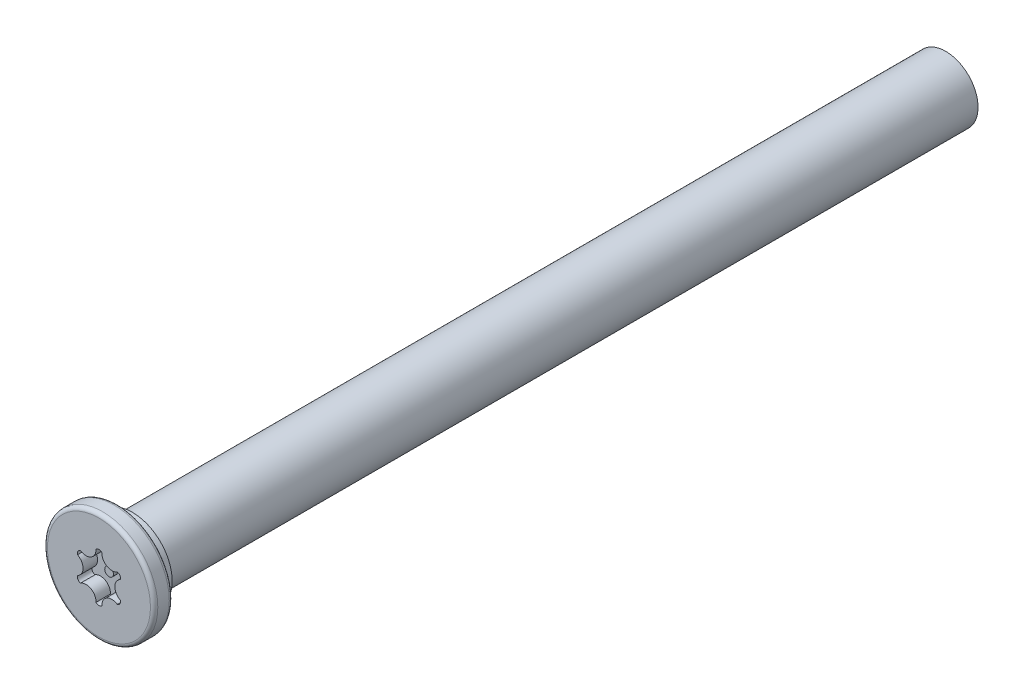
ISO-10303-21;
HEADER;
FILE_DESCRIPTION(('STEP AP214'),'2;1');
FILE_NAME('part.step','',(''),(''),'','','');
FILE_SCHEMA(('AUTOMOTIVE_DESIGN { 1 0 10303 214 1 1 1 1 }'));
ENDSEC;
DATA;
#1=APPLICATION_CONTEXT('core data for automotive mechanical design processes');
#2=APPLICATION_PROTOCOL_DEFINITION('international standard','automotive_design',2000,#1);
#3=PRODUCT_CONTEXT('',#1,'mechanical');
#4=PRODUCT('Part','Part','',(#3));
#5=PRODUCT_RELATED_PRODUCT_CATEGORY('part','',(#4));
#6=PRODUCT_DEFINITION_FORMATION('','',#4);
#7=PRODUCT_DEFINITION_CONTEXT('part definition',#1,'design');
#8=PRODUCT_DEFINITION('design','',#6,#7);
#9=PRODUCT_DEFINITION_SHAPE('','',#8);
#10=(LENGTH_UNIT() NAMED_UNIT(*) SI_UNIT(.MILLI.,.METRE.));
#11=(NAMED_UNIT(*) PLANE_ANGLE_UNIT() SI_UNIT($,.RADIAN.));
#12=(NAMED_UNIT(*) SI_UNIT($,.STERADIAN.) SOLID_ANGLE_UNIT());
#13=UNCERTAINTY_MEASURE_WITH_UNIT(LENGTH_MEASURE(1.E-05),#10,'distance_accuracy_value','');
#14=(GEOMETRIC_REPRESENTATION_CONTEXT(3) GLOBAL_UNCERTAINTY_ASSIGNED_CONTEXT((#13)) GLOBAL_UNIT_ASSIGNED_CONTEXT((#10,
#11,#12)) REPRESENTATION_CONTEXT('',''));
#15=CARTESIAN_POINT('',(0.,0.,0.));
#16=DIRECTION('',(0.,0.,1.));
#17=DIRECTION('',(1.,0.,0.));
#18=AXIS2_PLACEMENT_3D('',#15,#16,#17);
#19=CARTESIAN_POINT('',(0.,0.,0.));
#20=DIRECTION('',(0.,0.,1.));
#21=DIRECTION('',(1.,0.,0.));
#22=AXIS2_PLACEMENT_3D('',#19,#20,#21);
#23=PLANE('',#22);
#24=CARTESIAN_POINT('',(0.,0.,0.));
#25=DIRECTION('',(0.,0.,1.));
#26=DIRECTION('',(1.,0.,0.));
#27=AXIS2_PLACEMENT_3D('',#24,#25,#26);
#28=CIRCLE('',#27,3.55599999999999);
#29=CARTESIAN_POINT('',(3.55599999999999,0.,0.));
#30=VERTEX_POINT('',#29);
#31=EDGE_CURVE('E54',#30,#30,#28,.T.);
#32=ORIENTED_EDGE('',*,*,#31,.T.);
#33=EDGE_LOOP('',(#32));
#34=FACE_BOUND('',#33,.T.);
#35=CARTESIAN_POINT('',(0.893828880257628,1.54815703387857,0.));
#36=DIRECTION('',(0.,0.,1.));
#37=DIRECTION('',(1.,0.,0.));
#38=AXIS2_PLACEMENT_3D('',#35,#36,#37);
#39=CIRCLE('',#38,0.69);
#40=CARTESIAN_POINT('',(0.205060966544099,1.58937306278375,0.));
#41=VERTEX_POINT('',#40);
#42=CARTESIAN_POINT('',(1.27390696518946,0.972274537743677,0.));
#43=VERTEX_POINT('',#42);
#44=EDGE_CURVE('E181',#41,#43,#39,.T.);
#45=ORIENTED_EDGE('',*,*,#44,.T.);
#46=CARTESIAN_POINT('',(1.19884944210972,0.692156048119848,0.));
#47=DIRECTION('',(0.,0.,1.));
#48=DIRECTION('',(1.,0.,0.));
#49=AXIS2_PLACEMENT_3D('',#46,#47,#48);
#50=CIRCLE('',#49,0.29);
#51=CARTESIAN_POINT('',(1.47896793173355,0.617098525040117,0.));
#52=VERTEX_POINT('',#51);
#53=EDGE_CURVE('E61',#43,#52,#50,.F.);
#54=ORIENTED_EDGE('',*,*,#53,.T.);
#55=CARTESIAN_POINT('',(1.78765776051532,0.,0.));
#56=DIRECTION('',(0.,0.,1.));
#57=DIRECTION('',(1.,0.,0.));
#58=AXIS2_PLACEMENT_3D('',#55,#56,#57);
#59=CIRCLE('',#58,0.69);
#60=CARTESIAN_POINT('',(1.47896793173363,-0.617098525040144,0.));
#61=VERTEX_POINT('',#60);
#62=EDGE_CURVE('E111',#52,#61,#59,.T.);
#63=ORIENTED_EDGE('',*,*,#62,.T.);
#64=CARTESIAN_POINT('',(1.1988494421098,-0.692156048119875,0.));
#65=DIRECTION('',(0.,0.,1.));
#66=DIRECTION('',(1.,0.,0.));
#67=AXIS2_PLACEMENT_3D('',#64,#65,#66);
#68=CIRCLE('',#67,0.29);
#69=CARTESIAN_POINT('',(1.27390696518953,-0.972274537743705,0.));
#70=VERTEX_POINT('',#69);
#71=EDGE_CURVE('E216',#61,#70,#68,.F.);
#72=ORIENTED_EDGE('',*,*,#71,.T.);
#73=CARTESIAN_POINT('',(0.893828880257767,-1.54815703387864,0.));
#74=DIRECTION('',(0.,0.,1.));
#75=DIRECTION('',(1.,0.,0.));
#76=AXIS2_PLACEMENT_3D('',#73,#74,#75);
#77=CIRCLE('',#76,0.69);
#78=CARTESIAN_POINT('',(0.205060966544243,-1.5893730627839,0.));
#79=VERTEX_POINT('',#78);
#80=EDGE_CURVE('E160',#70,#79,#77,.T.);
#81=ORIENTED_EDGE('',*,*,#80,.T.);
#82=CARTESIAN_POINT('',(1.43067375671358E-13,-1.3843120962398,0.));
#83=DIRECTION('',(0.,0.,1.));
#84=DIRECTION('',(1.,0.,0.));
#85=AXIS2_PLACEMENT_3D('',#82,#83,#84);
#86=CIRCLE('',#85,0.29);
#87=CARTESIAN_POINT('',(-0.205060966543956,-1.5893730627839,0.));
#88=VERTEX_POINT('',#87);
#89=EDGE_CURVE('E210',#79,#88,#86,.F.);
#90=ORIENTED_EDGE('',*,*,#89,.T.);
#91=CARTESIAN_POINT('',(-0.893828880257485,-1.54815703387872,0.));
#92=DIRECTION('',(0.,0.,1.));
#93=DIRECTION('',(1.,0.,0.));
#94=AXIS2_PLACEMENT_3D('',#91,#92,#93);
#95=CIRCLE('',#94,0.69);
#96=CARTESIAN_POINT('',(-1.27390696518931,-0.97227453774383,0.));
#97=VERTEX_POINT('',#96);
#98=EDGE_CURVE('E206',#88,#97,#95,.T.);
#99=ORIENTED_EDGE('',*,*,#98,.T.);
#100=CARTESIAN_POINT('',(-1.19884944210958,-0.69215604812,0.));
#101=DIRECTION('',(0.,0.,1.));
#102=DIRECTION('',(1.,0.,0.));
#103=AXIS2_PLACEMENT_3D('',#100,#101,#102);
#104=CIRCLE('',#103,0.29);
#105=CARTESIAN_POINT('',(-1.47896793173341,-0.617098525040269,0.));
#106=VERTEX_POINT('',#105);
#107=EDGE_CURVE('E202',#97,#106,#104,.F.);
#108=ORIENTED_EDGE('',*,*,#107,.T.);
#109=CARTESIAN_POINT('',(-1.78765776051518,-1.56674837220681E-13,0.));
#110=DIRECTION('',(0.,0.,1.));
#111=DIRECTION('',(1.,0.,0.));
#112=AXIS2_PLACEMENT_3D('',#109,#110,#111);
#113=CIRCLE('',#112,0.69);
#114=CARTESIAN_POINT('',(-1.47896793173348,0.617098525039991,0.));
#115=VERTEX_POINT('',#114);
#116=EDGE_CURVE('E198',#106,#115,#113,.T.);
#117=ORIENTED_EDGE('',*,*,#116,.T.);
#118=CARTESIAN_POINT('',(-1.19884944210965,0.692156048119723,0.));
#119=DIRECTION('',(0.,0.,1.));
#120=DIRECTION('',(1.,0.,0.));
#121=AXIS2_PLACEMENT_3D('',#118,#119,#120);
#122=CIRCLE('',#121,0.29);
#123=CARTESIAN_POINT('',(-1.27390696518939,0.972274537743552,0.));
#124=VERTEX_POINT('',#123);
#125=EDGE_CURVE('E194',#115,#124,#122,.F.);
#126=ORIENTED_EDGE('',*,*,#125,.T.);
#127=CARTESIAN_POINT('',(-0.893828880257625,1.54815703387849,0.));
#128=DIRECTION('',(0.,0.,1.));
#129=DIRECTION('',(1.,0.,0.));
#130=AXIS2_PLACEMENT_3D('',#127,#128,#129);
#131=CIRCLE('',#130,0.690000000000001);
#132=CARTESIAN_POINT('',(-0.205060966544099,1.58937306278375,0.));
#133=VERTEX_POINT('',#132);
#134=EDGE_CURVE('E190',#124,#133,#131,.T.);
#135=ORIENTED_EDGE('',*,*,#134,.T.);
#136=CARTESIAN_POINT('',(0.,1.38431209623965,0.));
#137=DIRECTION('',(0.,0.,1.));
#138=DIRECTION('',(1.,0.,0.));
#139=AXIS2_PLACEMENT_3D('',#136,#137,#138);
#140=CIRCLE('',#139,0.29);
#141=EDGE_CURVE('E186',#133,#41,#140,.F.);
#142=ORIENTED_EDGE('',*,*,#141,.T.);
#143=EDGE_LOOP('',(#45,#54,#63,#72,#81,#90,#99,#108,#117,#126,#135,#142));
#144=FACE_BOUND('',#143,.T.);
#145=ADVANCED_FACE('F45',(#34,#144),#23,.T.);
#146=CARTESIAN_POINT('',(0.,0.,-1.3));
#147=DIRECTION('',(0.,0.,1.));
#148=DIRECTION('',(1.,0.,0.));
#149=AXIS2_PLACEMENT_3D('',#146,#147,#148);
#150=PLANE('',#149);
#151=CARTESIAN_POINT('',(0.,0.,-1.3));
#152=DIRECTION('',(0.,0.,1.));
#153=DIRECTION('',(1.,0.,0.));
#154=AXIS2_PLACEMENT_3D('',#151,#152,#153);
#155=CIRCLE('',#154,2.738000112);
#156=CARTESIAN_POINT('',(2.738000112,0.,-1.3));
#157=VERTEX_POINT('',#156);
#158=EDGE_CURVE('E11',#157,#157,#155,.F.);
#159=ORIENTED_EDGE('',*,*,#158,.F.);
#160=EDGE_LOOP('',(#159));
#161=FACE_BOUND('',#160,.T.);
#162=CARTESIAN_POINT('',(0.,0.,-1.3));
#163=DIRECTION('',(0.,0.,1.));
#164=DIRECTION('',(1.,0.,0.));
#165=AXIS2_PLACEMENT_3D('',#162,#163,#164);
#166=CIRCLE('',#165,3.55599999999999);
#167=CARTESIAN_POINT('',(3.55599999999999,0.,-1.3));
#168=VERTEX_POINT('',#167);
#169=EDGE_CURVE('E260',#168,#168,#166,.F.);
#170=ORIENTED_EDGE('',*,*,#169,.T.);
#171=EDGE_LOOP('',(#170));
#172=FACE_BOUND('',#171,.T.);
#173=ADVANCED_FACE('F283',(#161,#172),#150,.F.);
#174=CARTESIAN_POINT('',(0.,0.,-1.3));
#175=DIRECTION('',(0.,0.,1.));
#176=DIRECTION('',(1.,0.,0.));
#177=AXIS2_PLACEMENT_3D('',#174,#175,#176);
#178=CYLINDRICAL_SURFACE('',#177,3.80999999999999);
#179=CARTESIAN_POINT('',(0.,0.,-1.046));
#180=DIRECTION('',(0.,0.,1.));
#181=DIRECTION('',(1.,0.,0.));
#182=AXIS2_PLACEMENT_3D('',#179,#180,#181);
#183=CIRCLE('',#182,3.80999999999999);
#184=CARTESIAN_POINT('',(3.80999999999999,0.,-1.046));
#185=VERTEX_POINT('',#184);
#186=EDGE_CURVE('E256',#185,#185,#183,.T.);
#187=ORIENTED_EDGE('',*,*,#186,.T.);
#188=EDGE_LOOP('',(#187));
#189=FACE_BOUND('',#188,.T.);
#190=CARTESIAN_POINT('',(0.,0.,-0.254));
#191=DIRECTION('',(0.,0.,1.));
#192=DIRECTION('',(1.,0.,0.));
#193=AXIS2_PLACEMENT_3D('',#190,#191,#192);
#194=CIRCLE('',#193,3.80999999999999);
#195=CARTESIAN_POINT('',(3.80999999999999,0.,-0.254));
#196=VERTEX_POINT('',#195);
#197=EDGE_CURVE('E225',#196,#196,#194,.F.);
#198=ORIENTED_EDGE('',*,*,#197,.T.);
#199=EDGE_LOOP('',(#198));
#200=FACE_BOUND('',#199,.T.);
#201=ADVANCED_FACE('F289',(#189,#200),#178,.T.);
#202=CARTESIAN_POINT('',(1.19884944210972,0.692156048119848,-1.));
#203=DIRECTION('',(0.,0.,1.));
#204=DIRECTION('',(1.,0.,0.));
#205=AXIS2_PLACEMENT_3D('',#202,#203,#204);
#206=CYLINDRICAL_SURFACE('',#205,0.29);
#207=ORIENTED_EDGE('',*,*,#53,.F.);
#208=DIRECTION('',(0.,0.,1.));
#209=VECTOR('',#208,1.);
#210=CARTESIAN_POINT('',(1.27390696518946,0.972274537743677,-1.));
#211=LINE('',#210,#209);
#212=CARTESIAN_POINT('',(1.27390696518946,0.972274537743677,-1.));
#213=VERTEX_POINT('',#212);
#214=EDGE_CURVE('E178',#213,#43,#211,.T.);
#215=ORIENTED_EDGE('',*,*,#214,.F.);
#216=CARTESIAN_POINT('',(1.19884944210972,0.692156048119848,-1.));
#217=DIRECTION('',(0.,0.,1.));
#218=DIRECTION('',(1.,0.,0.));
#219=AXIS2_PLACEMENT_3D('',#216,#217,#218);
#220=CIRCLE('',#219,0.29);
#221=CARTESIAN_POINT('',(1.47896793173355,0.617098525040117,-1.));
#222=VERTEX_POINT('',#221);
#223=EDGE_CURVE('E221',#213,#222,#220,.F.);
#224=ORIENTED_EDGE('',*,*,#223,.T.);
#225=DIRECTION('',(0.,0.,1.));
#226=VECTOR('',#225,1.);
#227=CARTESIAN_POINT('',(1.47896793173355,0.617098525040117,-1.));
#228=LINE('',#227,#226);
#229=EDGE_CURVE('E222',#222,#52,#228,.T.);
#230=ORIENTED_EDGE('',*,*,#229,.T.);
#231=EDGE_LOOP('',(#207,#215,#224,#230));
#232=FACE_BOUND('',#231,.T.);
#233=ADVANCED_FACE('F294',(#232),#206,.F.);
#234=CARTESIAN_POINT('',(1.78765776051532,0.,-1.));
#235=DIRECTION('',(0.,0.,1.));
#236=DIRECTION('',(1.,0.,0.));
#237=AXIS2_PLACEMENT_3D('',#234,#235,#236);
#238=CYLINDRICAL_SURFACE('',#237,0.69);
#239=ORIENTED_EDGE('',*,*,#62,.F.);
#240=ORIENTED_EDGE('',*,*,#229,.F.);
#241=CARTESIAN_POINT('',(1.78765776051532,0.,-1.));
#242=DIRECTION('',(0.,0.,1.));
#243=DIRECTION('',(1.,0.,0.));
#244=AXIS2_PLACEMENT_3D('',#241,#242,#243);
#245=CIRCLE('',#244,0.69);
#246=CARTESIAN_POINT('',(1.47896793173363,-0.617098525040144,-1.));
#247=VERTEX_POINT('',#246);
#248=EDGE_CURVE('E70',#222,#247,#245,.T.);
#249=ORIENTED_EDGE('',*,*,#248,.T.);
#250=DIRECTION('',(0.,0.,1.));
#251=VECTOR('',#250,1.);
#252=CARTESIAN_POINT('',(1.47896793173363,-0.617098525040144,-1.));
#253=LINE('',#252,#251);
#254=EDGE_CURVE('E151',#247,#61,#253,.T.);
#255=ORIENTED_EDGE('',*,*,#254,.T.);
#256=EDGE_LOOP('',(#239,#240,#249,#255));
#257=FACE_BOUND('',#256,.T.);
#258=ADVANCED_FACE('F301',(#257),#238,.T.);
#259=CARTESIAN_POINT('',(1.1988494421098,-0.692156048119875,-1.));
#260=DIRECTION('',(0.,0.,1.));
#261=DIRECTION('',(1.,0.,0.));
#262=AXIS2_PLACEMENT_3D('',#259,#260,#261);
#263=CYLINDRICAL_SURFACE('',#262,0.29);
#264=ORIENTED_EDGE('',*,*,#71,.F.);
#265=ORIENTED_EDGE('',*,*,#254,.F.);
#266=CARTESIAN_POINT('',(1.1988494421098,-0.692156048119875,-1.));
#267=DIRECTION('',(0.,0.,1.));
#268=DIRECTION('',(1.,0.,0.));
#269=AXIS2_PLACEMENT_3D('',#266,#267,#268);
#270=CIRCLE('',#269,0.29);
#271=CARTESIAN_POINT('',(1.27390696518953,-0.972274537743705,-1.));
#272=VERTEX_POINT('',#271);
#273=EDGE_CURVE('E145',#247,#272,#270,.F.);
#274=ORIENTED_EDGE('',*,*,#273,.T.);
#275=DIRECTION('',(0.,0.,1.));
#276=VECTOR('',#275,1.);
#277=CARTESIAN_POINT('',(1.27390696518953,-0.972274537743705,-1.));
#278=LINE('',#277,#276);
#279=EDGE_CURVE('E149',#272,#70,#278,.T.);
#280=ORIENTED_EDGE('',*,*,#279,.T.);
#281=EDGE_LOOP('',(#264,#265,#274,#280));
#282=FACE_BOUND('',#281,.T.);
#283=ADVANCED_FACE('F148',(#282),#263,.F.);
#284=CARTESIAN_POINT('',(0.893828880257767,-1.54815703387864,-1.));
#285=DIRECTION('',(0.,0.,1.));
#286=DIRECTION('',(1.,0.,0.));
#287=AXIS2_PLACEMENT_3D('',#284,#285,#286);
#288=CYLINDRICAL_SURFACE('',#287,0.69);
#289=ORIENTED_EDGE('',*,*,#80,.F.);
#290=ORIENTED_EDGE('',*,*,#279,.F.);
#291=CARTESIAN_POINT('',(0.893828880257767,-1.54815703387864,-1.));
#292=DIRECTION('',(0.,0.,1.));
#293=DIRECTION('',(1.,0.,0.));
#294=AXIS2_PLACEMENT_3D('',#291,#292,#293);
#295=CIRCLE('',#294,0.69);
#296=CARTESIAN_POINT('',(0.205060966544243,-1.5893730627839,-1.));
#297=VERTEX_POINT('',#296);
#298=EDGE_CURVE('E154',#272,#297,#295,.T.);
#299=ORIENTED_EDGE('',*,*,#298,.T.);
#300=DIRECTION('',(0.,0.,1.));
#301=VECTOR('',#300,1.);
#302=CARTESIAN_POINT('',(0.205060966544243,-1.5893730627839,-1.));
#303=LINE('',#302,#301);
#304=EDGE_CURVE('E163',#297,#79,#303,.T.);
#305=ORIENTED_EDGE('',*,*,#304,.T.);
#306=EDGE_LOOP('',(#289,#290,#299,#305));
#307=FACE_BOUND('',#306,.T.);
#308=ADVANCED_FACE('F157',(#307),#288,.T.);
#309=CARTESIAN_POINT('',(1.43067375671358E-13,-1.3843120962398,-1.));
#310=DIRECTION('',(0.,0.,1.));
#311=DIRECTION('',(1.,0.,0.));
#312=AXIS2_PLACEMENT_3D('',#309,#310,#311);
#313=CYLINDRICAL_SURFACE('',#312,0.29);
#314=ORIENTED_EDGE('',*,*,#89,.F.);
#315=ORIENTED_EDGE('',*,*,#304,.F.);
#316=CARTESIAN_POINT('',(1.43067375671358E-13,-1.3843120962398,-1.));
#317=DIRECTION('',(0.,0.,1.));
#318=DIRECTION('',(1.,0.,0.));
#319=AXIS2_PLACEMENT_3D('',#316,#317,#318);
#320=CIRCLE('',#319,0.29);
#321=CARTESIAN_POINT('',(-0.205060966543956,-1.5893730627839,-1.));
#322=VERTEX_POINT('',#321);
#323=EDGE_CURVE('E168',#297,#322,#320,.F.);
#324=ORIENTED_EDGE('',*,*,#323,.T.);
#325=DIRECTION('',(0.,0.,1.));
#326=VECTOR('',#325,1.);
#327=CARTESIAN_POINT('',(-0.205060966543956,-1.5893730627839,-1.));
#328=LINE('',#327,#326);
#329=EDGE_CURVE('E230',#322,#88,#328,.T.);
#330=ORIENTED_EDGE('',*,*,#329,.T.);
#331=EDGE_LOOP('',(#314,#315,#324,#330));
#332=FACE_BOUND('',#331,.T.);
#333=ADVANCED_FACE('F318',(#332),#313,.F.);
#334=CARTESIAN_POINT('',(-0.893828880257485,-1.54815703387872,-1.));
#335=DIRECTION('',(0.,0.,1.));
#336=DIRECTION('',(1.,0.,0.));
#337=AXIS2_PLACEMENT_3D('',#334,#335,#336);
#338=CYLINDRICAL_SURFACE('',#337,0.69);
#339=ORIENTED_EDGE('',*,*,#98,.F.);
#340=ORIENTED_EDGE('',*,*,#329,.F.);
#341=CARTESIAN_POINT('',(-0.893828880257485,-1.54815703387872,-1.));
#342=DIRECTION('',(0.,0.,1.));
#343=DIRECTION('',(1.,0.,0.));
#344=AXIS2_PLACEMENT_3D('',#341,#342,#343);
#345=CIRCLE('',#344,0.69);
#346=CARTESIAN_POINT('',(-1.27390696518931,-0.97227453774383,-1.));
#347=VERTEX_POINT('',#346);
#348=EDGE_CURVE('E172',#322,#347,#345,.T.);
#349=ORIENTED_EDGE('',*,*,#348,.T.);
#350=DIRECTION('',(0.,0.,1.));
#351=VECTOR('',#350,1.);
#352=CARTESIAN_POINT('',(-1.27390696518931,-0.97227453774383,-1.));
#353=LINE('',#352,#351);
#354=EDGE_CURVE('E233',#347,#97,#353,.T.);
#355=ORIENTED_EDGE('',*,*,#354,.T.);
#356=EDGE_LOOP('',(#339,#340,#349,#355));
#357=FACE_BOUND('',#356,.T.);
#358=ADVANCED_FACE('F321',(#357),#338,.T.);
#359=CARTESIAN_POINT('',(-1.19884944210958,-0.69215604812,-1.));
#360=DIRECTION('',(0.,0.,1.));
#361=DIRECTION('',(1.,0.,0.));
#362=AXIS2_PLACEMENT_3D('',#359,#360,#361);
#363=CYLINDRICAL_SURFACE('',#362,0.29);
#364=ORIENTED_EDGE('',*,*,#107,.F.);
#365=ORIENTED_EDGE('',*,*,#354,.F.);
#366=CARTESIAN_POINT('',(-1.19884944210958,-0.69215604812,-1.));
#367=DIRECTION('',(0.,0.,1.));
#368=DIRECTION('',(1.,0.,0.));
#369=AXIS2_PLACEMENT_3D('',#366,#367,#368);
#370=CIRCLE('',#369,0.29);
#371=CARTESIAN_POINT('',(-1.47896793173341,-0.617098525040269,-1.));
#372=VERTEX_POINT('',#371);
#373=EDGE_CURVE('E374',#347,#372,#370,.F.);
#374=ORIENTED_EDGE('',*,*,#373,.T.);
#375=DIRECTION('',(0.,0.,1.));
#376=VECTOR('',#375,1.);
#377=CARTESIAN_POINT('',(-1.47896793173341,-0.617098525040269,-1.));
#378=LINE('',#377,#376);
#379=EDGE_CURVE('E236',#372,#106,#378,.T.);
#380=ORIENTED_EDGE('',*,*,#379,.T.);
#381=EDGE_LOOP('',(#364,#365,#374,#380));
#382=FACE_BOUND('',#381,.T.);
#383=ADVANCED_FACE('F325',(#382),#363,.F.);
#384=CARTESIAN_POINT('',(-1.78765776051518,-1.56674837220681E-13,-1.));
#385=DIRECTION('',(0.,0.,1.));
#386=DIRECTION('',(1.,0.,0.));
#387=AXIS2_PLACEMENT_3D('',#384,#385,#386);
#388=CYLINDRICAL_SURFACE('',#387,0.69);
#389=ORIENTED_EDGE('',*,*,#116,.F.);
#390=ORIENTED_EDGE('',*,*,#379,.F.);
#391=CARTESIAN_POINT('',(-1.78765776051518,-1.56674837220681E-13,-1.));
#392=DIRECTION('',(0.,0.,1.));
#393=DIRECTION('',(1.,0.,0.));
#394=AXIS2_PLACEMENT_3D('',#391,#392,#393);
#395=CIRCLE('',#394,0.69);
#396=CARTESIAN_POINT('',(-1.47896793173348,0.617098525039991,-1.));
#397=VERTEX_POINT('',#396);
#398=EDGE_CURVE('E371',#372,#397,#395,.T.);
#399=ORIENTED_EDGE('',*,*,#398,.T.);
#400=DIRECTION('',(0.,0.,1.));
#401=VECTOR('',#400,1.);
#402=CARTESIAN_POINT('',(-1.47896793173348,0.617098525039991,-1.));
#403=LINE('',#402,#401);
#404=EDGE_CURVE('E239',#397,#115,#403,.T.);
#405=ORIENTED_EDGE('',*,*,#404,.T.);
#406=EDGE_LOOP('',(#389,#390,#399,#405));
#407=FACE_BOUND('',#406,.T.);
#408=ADVANCED_FACE('F329',(#407),#388,.T.);
#409=CARTESIAN_POINT('',(-1.19884944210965,0.692156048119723,-1.));
#410=DIRECTION('',(0.,0.,1.));
#411=DIRECTION('',(1.,0.,0.));
#412=AXIS2_PLACEMENT_3D('',#409,#410,#411);
#413=CYLINDRICAL_SURFACE('',#412,0.29);
#414=ORIENTED_EDGE('',*,*,#125,.F.);
#415=ORIENTED_EDGE('',*,*,#404,.F.);
#416=CARTESIAN_POINT('',(-1.19884944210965,0.692156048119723,-1.));
#417=DIRECTION('',(0.,0.,1.));
#418=DIRECTION('',(1.,0.,0.));
#419=AXIS2_PLACEMENT_3D('',#416,#417,#418);
#420=CIRCLE('',#419,0.29);
#421=CARTESIAN_POINT('',(-1.27390696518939,0.972274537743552,-1.));
#422=VERTEX_POINT('',#421);
#423=EDGE_CURVE('E364',#397,#422,#420,.F.);
#424=ORIENTED_EDGE('',*,*,#423,.T.);
#425=DIRECTION('',(0.,0.,1.));
#426=VECTOR('',#425,1.);
#427=CARTESIAN_POINT('',(-1.27390696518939,0.972274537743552,-1.));
#428=LINE('',#427,#426);
#429=EDGE_CURVE('E242',#422,#124,#428,.T.);
#430=ORIENTED_EDGE('',*,*,#429,.T.);
#431=EDGE_LOOP('',(#414,#415,#424,#430));
#432=FACE_BOUND('',#431,.T.);
#433=ADVANCED_FACE('F333',(#432),#413,.F.);
#434=CARTESIAN_POINT('',(-0.893828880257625,1.54815703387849,-1.));
#435=DIRECTION('',(0.,0.,1.));
#436=DIRECTION('',(1.,0.,0.));
#437=AXIS2_PLACEMENT_3D('',#434,#435,#436);
#438=CYLINDRICAL_SURFACE('',#437,0.690000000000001);
#439=ORIENTED_EDGE('',*,*,#134,.F.);
#440=ORIENTED_EDGE('',*,*,#429,.F.);
#441=CARTESIAN_POINT('',(-0.893828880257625,1.54815703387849,-1.));
#442=DIRECTION('',(0.,0.,1.));
#443=DIRECTION('',(1.,0.,0.));
#444=AXIS2_PLACEMENT_3D('',#441,#442,#443);
#445=CIRCLE('',#444,0.690000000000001);
#446=CARTESIAN_POINT('',(-0.205060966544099,1.58937306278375,-1.));
#447=VERTEX_POINT('',#446);
#448=EDGE_CURVE('E360',#422,#447,#445,.T.);
#449=ORIENTED_EDGE('',*,*,#448,.T.);
#450=DIRECTION('',(0.,0.,1.));
#451=VECTOR('',#450,1.);
#452=CARTESIAN_POINT('',(-0.205060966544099,1.58937306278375,-1.));
#453=LINE('',#452,#451);
#454=EDGE_CURVE('E245',#447,#133,#453,.T.);
#455=ORIENTED_EDGE('',*,*,#454,.T.);
#456=EDGE_LOOP('',(#439,#440,#449,#455));
#457=FACE_BOUND('',#456,.T.);
#458=ADVANCED_FACE('F337',(#457),#438,.T.);
#459=CARTESIAN_POINT('',(0.,1.38431209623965,-1.));
#460=DIRECTION('',(0.,0.,1.));
#461=DIRECTION('',(1.,0.,0.));
#462=AXIS2_PLACEMENT_3D('',#459,#460,#461);
#463=CYLINDRICAL_SURFACE('',#462,0.29);
#464=ORIENTED_EDGE('',*,*,#141,.F.);
#465=ORIENTED_EDGE('',*,*,#454,.F.);
#466=CARTESIAN_POINT('',(0.,1.38431209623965,-1.));
#467=DIRECTION('',(0.,0.,1.));
#468=DIRECTION('',(1.,0.,0.));
#469=AXIS2_PLACEMENT_3D('',#466,#467,#468);
#470=CIRCLE('',#469,0.29);
#471=CARTESIAN_POINT('',(0.205060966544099,1.58937306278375,-1.));
#472=VERTEX_POINT('',#471);
#473=EDGE_CURVE('E357',#447,#472,#470,.F.);
#474=ORIENTED_EDGE('',*,*,#473,.T.);
#475=DIRECTION('',(0.,0.,1.));
#476=VECTOR('',#475,1.);
#477=CARTESIAN_POINT('',(0.205060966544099,1.58937306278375,-1.));
#478=LINE('',#477,#476);
#479=EDGE_CURVE('E248',#472,#41,#478,.T.);
#480=ORIENTED_EDGE('',*,*,#479,.T.);
#481=EDGE_LOOP('',(#464,#465,#474,#480));
#482=FACE_BOUND('',#481,.T.);
#483=ADVANCED_FACE('F341',(#482),#463,.F.);
#484=CARTESIAN_POINT('',(0.893828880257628,1.54815703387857,-1.));
#485=DIRECTION('',(0.,0.,1.));
#486=DIRECTION('',(1.,0.,0.));
#487=AXIS2_PLACEMENT_3D('',#484,#485,#486);
#488=CYLINDRICAL_SURFACE('',#487,0.69);
#489=ORIENTED_EDGE('',*,*,#44,.F.);
#490=ORIENTED_EDGE('',*,*,#479,.F.);
#491=CARTESIAN_POINT('',(0.893828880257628,1.54815703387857,-1.));
#492=DIRECTION('',(0.,0.,1.));
#493=DIRECTION('',(1.,0.,0.));
#494=AXIS2_PLACEMENT_3D('',#491,#492,#493);
#495=CIRCLE('',#494,0.69);
#496=EDGE_CURVE('E118',#472,#213,#495,.T.);
#497=ORIENTED_EDGE('',*,*,#496,.T.);
#498=ORIENTED_EDGE('',*,*,#214,.T.);
#499=EDGE_LOOP('',(#489,#490,#497,#498));
#500=FACE_BOUND('',#499,.T.);
#501=ADVANCED_FACE('F344',(#500),#488,.T.);
#502=CARTESIAN_POINT('',(0.,0.,-1.));
#503=DIRECTION('',(0.,0.,1.));
#504=DIRECTION('',(1.,0.,0.));
#505=AXIS2_PLACEMENT_3D('',#502,#503,#504);
#506=PLANE('',#505);
#507=CARTESIAN_POINT('',(0.,0.,-1.));
#508=DIRECTION('',(0.,0.,1.));
#509=DIRECTION('',(1.,0.,0.));
#510=AXIS2_PLACEMENT_3D('',#507,#508,#509);
#511=CIRCLE('',#510,0.3);
#512=CARTESIAN_POINT('',(0.3,0.,-1.));
#513=VERTEX_POINT('',#512);
#514=EDGE_CURVE('E396',#513,#513,#511,.T.);
#515=ORIENTED_EDGE('',*,*,#514,.F.);
#516=EDGE_LOOP('',(#515));
#517=FACE_BOUND('',#516,.T.);
#518=ORIENTED_EDGE('',*,*,#223,.F.);
#519=ORIENTED_EDGE('',*,*,#496,.F.);
#520=ORIENTED_EDGE('',*,*,#473,.F.);
#521=ORIENTED_EDGE('',*,*,#448,.F.);
#522=ORIENTED_EDGE('',*,*,#423,.F.);
#523=ORIENTED_EDGE('',*,*,#398,.F.);
#524=ORIENTED_EDGE('',*,*,#373,.F.);
#525=ORIENTED_EDGE('',*,*,#348,.F.);
#526=ORIENTED_EDGE('',*,*,#323,.F.);
#527=ORIENTED_EDGE('',*,*,#298,.F.);
#528=ORIENTED_EDGE('',*,*,#273,.F.);
#529=ORIENTED_EDGE('',*,*,#248,.F.);
#530=EDGE_LOOP('',(#518,#519,#520,#521,#522,#523,#524,#525,#526,#527,#528,#529));
#531=FACE_BOUND('',#530,.T.);
#532=ADVANCED_FACE('F166',(#517,#531),#506,.T.);
#533=CARTESIAN_POINT('',(0.,0.,-1.046));
#534=DIRECTION('',(0.,0.,1.));
#535=DIRECTION('',(1.,0.,0.));
#536=AXIS2_PLACEMENT_3D('',#533,#534,#535);
#537=TOROIDAL_SURFACE('',#536,3.55599999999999,0.254);
#538=ORIENTED_EDGE('',*,*,#169,.F.);
#539=EDGE_LOOP('',(#538));
#540=FACE_BOUND('',#539,.T.);
#541=ORIENTED_EDGE('',*,*,#186,.F.);
#542=EDGE_LOOP('',(#541));
#543=FACE_BOUND('',#542,.T.);
#544=ADVANCED_FACE('F271',(#540,#543),#537,.T.);
#545=CARTESIAN_POINT('',(0.,0.,-0.254));
#546=DIRECTION('',(0.,0.,1.));
#547=DIRECTION('',(1.,0.,0.));
#548=AXIS2_PLACEMENT_3D('',#545,#546,#547);
#549=TOROIDAL_SURFACE('',#548,3.55599999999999,0.254);
#550=ORIENTED_EDGE('',*,*,#197,.F.);
#551=EDGE_LOOP('',(#550));
#552=FACE_BOUND('',#551,.T.);
#553=ORIENTED_EDGE('',*,*,#31,.F.);
#554=EDGE_LOOP('',(#553));
#555=FACE_BOUND('',#554,.T.);
#556=ADVANCED_FACE('F47',(#552,#555),#549,.T.);
#557=CARTESIAN_POINT('',(0.,0.,-2.316));
#558=DIRECTION('',(0.,0.,-1.));
#559=DIRECTION('',(-1.,0.,0.));
#560=AXIS2_PLACEMENT_3D('',#557,#558,#559);
#561=PLANE('',#560);
#562=CARTESIAN_POINT('',(0.,0.,-2.316));
#563=DIRECTION('',(0.,0.,-1.));
#564=DIRECTION('',(-1.,0.,0.));
#565=AXIS2_PLACEMENT_3D('',#562,#563,#564);
#566=CIRCLE('',#565,2.738000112);
#567=CARTESIAN_POINT('',(-2.738000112,0.,-2.316));
#568=VERTEX_POINT('',#567);
#569=EDGE_CURVE('E182',#568,#568,#566,.T.);
#570=ORIENTED_EDGE('',*,*,#569,.T.);
#571=EDGE_LOOP('',(#570));
#572=FACE_BOUND('',#571,.T.);
#573=CARTESIAN_POINT('',(0.,0.,-2.316));
#574=DIRECTION('',(0.,0.,-1.));
#575=DIRECTION('',(-1.,0.,0.));
#576=AXIS2_PLACEMENT_3D('',#573,#574,#575);
#577=CIRCLE('',#576,2.230000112);
#578=CARTESIAN_POINT('',(-2.230000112,0.,-2.316));
#579=VERTEX_POINT('',#578);
#580=EDGE_CURVE('E400',#579,#579,#577,.T.);
#581=ORIENTED_EDGE('',*,*,#580,.F.);
#582=EDGE_LOOP('',(#581));
#583=FACE_BOUND('',#582,.T.);
#584=ADVANCED_FACE('F270',(#572,#583),#561,.T.);
#585=CARTESIAN_POINT('',(0.,0.,-2.316));
#586=DIRECTION('',(0.,0.,1.));
#587=DIRECTION('',(1.,0.,0.));
#588=AXIS2_PLACEMENT_3D('',#585,#586,#587);
#589=CYLINDRICAL_SURFACE('',#588,2.738000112);
#590=ORIENTED_EDGE('',*,*,#569,.F.);
#591=EDGE_LOOP('',(#590));
#592=FACE_BOUND('',#591,.T.);
#593=ORIENTED_EDGE('',*,*,#158,.T.);
#594=EDGE_LOOP('',(#593));
#595=FACE_BOUND('',#594,.T.);
#596=ADVANCED_FACE('F277',(#592,#595),#589,.T.);
#597=CARTESIAN_POINT('',(0.,0.,-0.7));
#598=DIRECTION('',(0.,0.,-1.));
#599=DIRECTION('',(-1.,0.,0.));
#600=AXIS2_PLACEMENT_3D('',#597,#598,#599);
#601=CYLINDRICAL_SURFACE('',#600,0.3);
#602=CARTESIAN_POINT('',(0.,0.,-0.7));
#603=DIRECTION('',(0.,0.,1.));
#604=DIRECTION('',(1.,0.,0.));
#605=AXIS2_PLACEMENT_3D('',#602,#603,#604);
#606=CIRCLE('',#605,0.3);
#607=CARTESIAN_POINT('',(0.3,0.,-0.7));
#608=VERTEX_POINT('',#607);
#609=EDGE_CURVE('E395',#608,#608,#606,.T.);
#610=ORIENTED_EDGE('',*,*,#609,.F.);
#611=EDGE_LOOP('',(#610));
#612=FACE_BOUND('',#611,.T.);
#613=ORIENTED_EDGE('',*,*,#514,.T.);
#614=EDGE_LOOP('',(#613));
#615=FACE_BOUND('',#614,.T.);
#616=ADVANCED_FACE('F424',(#612,#615),#601,.T.);
#617=CARTESIAN_POINT('',(0.,0.,-0.7));
#618=DIRECTION('',(0.,0.,1.));
#619=DIRECTION('',(1.,0.,0.));
#620=AXIS2_PLACEMENT_3D('',#617,#618,#619);
#621=PLANE('',#620);
#622=ORIENTED_EDGE('',*,*,#609,.T.);
#623=EDGE_LOOP('',(#622));
#624=FACE_BOUND('',#623,.T.);
#625=ADVANCED_FACE('F416',(#624),#621,.T.);
#626=CARTESIAN_POINT('',(0.,0.,-58.45));
#627=DIRECTION('',(0.,0.,1.));
#628=DIRECTION('',(1.,0.,0.));
#629=AXIS2_PLACEMENT_3D('',#626,#627,#628);
#630=CYLINDRICAL_SURFACE('',#629,2.230000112);
#631=ORIENTED_EDGE('',*,*,#580,.T.);
#632=EDGE_LOOP('',(#631));
#633=FACE_BOUND('',#632,.T.);
#634=CARTESIAN_POINT('',(0.,0.,-58.45));
#635=DIRECTION('',(0.,0.,-1.));
#636=DIRECTION('',(-1.,0.,0.));
#637=AXIS2_PLACEMENT_3D('',#634,#635,#636);
#638=CIRCLE('',#637,2.230000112);
#639=CARTESIAN_POINT('',(-2.230000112,0.,-58.45));
#640=VERTEX_POINT('',#639);
#641=EDGE_CURVE('E407',#640,#640,#638,.T.);
#642=ORIENTED_EDGE('',*,*,#641,.F.);
#643=EDGE_LOOP('',(#642));
#644=FACE_BOUND('',#643,.T.);
#645=ADVANCED_FACE('F414',(#633,#644),#630,.T.);
#646=CARTESIAN_POINT('',(0.,0.,-58.45));
#647=DIRECTION('',(0.,0.,-1.));
#648=DIRECTION('',(-1.,0.,0.));
#649=AXIS2_PLACEMENT_3D('',#646,#647,#648);
#650=PLANE('',#649);
#651=ORIENTED_EDGE('',*,*,#641,.T.);
#652=EDGE_LOOP('',(#651));
#653=FACE_BOUND('',#652,.T.);
#654=ADVANCED_FACE('F412',(#653),#650,.T.);
#655=CLOSED_SHELL('',(#145,#173,#201,#233,#258,#283,#308,#333,#358,#383,#408,#433,#458,#483,
#501,#532,#544,#556,#584,#596,#616,#625,#645,#654));
#656=MANIFOLD_SOLID_BREP('B2',#655);
#657=ADVANCED_BREP_SHAPE_REPRESENTATION('',(#18,#656),#14);
#658=SHAPE_DEFINITION_REPRESENTATION(#9,#657);
ENDSEC;
END-ISO-10303-21;
